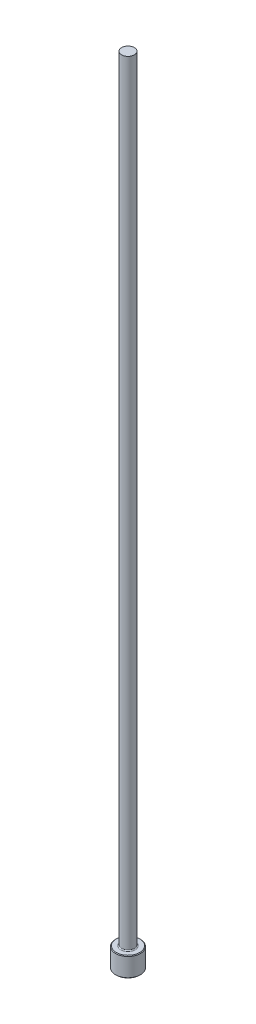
ISO-10303-21;
HEADER;
FILE_DESCRIPTION(('STEP AP214'),'2;1');
FILE_NAME('part.step','',(''),(''),'','','');
FILE_SCHEMA(('AUTOMOTIVE_DESIGN { 1 0 10303 214 1 1 1 1 }'));
ENDSEC;
DATA;
#1=APPLICATION_CONTEXT('core data for automotive mechanical design processes');
#2=APPLICATION_PROTOCOL_DEFINITION('international standard','automotive_design',2000,#1);
#3=PRODUCT_CONTEXT('',#1,'mechanical');
#4=PRODUCT('Part','Part','',(#3));
#5=PRODUCT_RELATED_PRODUCT_CATEGORY('part','',(#4));
#6=PRODUCT_DEFINITION_FORMATION('','',#4);
#7=PRODUCT_DEFINITION_CONTEXT('part definition',#1,'design');
#8=PRODUCT_DEFINITION('design','',#6,#7);
#9=PRODUCT_DEFINITION_SHAPE('','',#8);
#10=(LENGTH_UNIT() NAMED_UNIT(*) SI_UNIT(.MILLI.,.METRE.));
#11=(NAMED_UNIT(*) PLANE_ANGLE_UNIT() SI_UNIT($,.RADIAN.));
#12=(NAMED_UNIT(*) SI_UNIT($,.STERADIAN.) SOLID_ANGLE_UNIT());
#13=UNCERTAINTY_MEASURE_WITH_UNIT(LENGTH_MEASURE(1.E-05),#10,'distance_accuracy_value','');
#14=(GEOMETRIC_REPRESENTATION_CONTEXT(3) GLOBAL_UNCERTAINTY_ASSIGNED_CONTEXT((#13)) GLOBAL_UNIT_ASSIGNED_CONTEXT((#10,
#11,#12)) REPRESENTATION_CONTEXT('',''));
#15=CARTESIAN_POINT('',(0.,0.,0.));
#16=DIRECTION('',(0.,0.,1.));
#17=DIRECTION('',(1.,0.,0.));
#18=AXIS2_PLACEMENT_3D('',#15,#16,#17);
#19=CARTESIAN_POINT('',(0.,0.,0.));
#20=DIRECTION('',(0.,-1.,0.));
#21=DIRECTION('',(0.,0.,-1.));
#22=AXIS2_PLACEMENT_3D('',#19,#20,#21);
#23=PLANE('',#22);
#24=CARTESIAN_POINT('',(0.,0.,0.));
#25=DIRECTION('',(0.,-1.,0.));
#26=DIRECTION('',(0.,0.,-1.));
#27=AXIS2_PLACEMENT_3D('',#24,#25,#26);
#28=CIRCLE('',#27,0.939799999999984);
#29=CARTESIAN_POINT('',(0.,0.,0.939799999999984));
#30=VERTEX_POINT('',#29);
#31=EDGE_CURVE('E46',#30,#30,#28,.T.);
#32=ORIENTED_EDGE('',*,*,#31,.T.);
#33=EDGE_LOOP('',(#32));
#34=FACE_BOUND('',#33,.T.);
#35=ADVANCED_FACE('F35',(#34),#23,.T.);
#36=CARTESIAN_POINT('',(0.,259.958771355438,0.));
#37=DIRECTION('',(0.,1.,0.));
#38=DIRECTION('',(0.,0.,1.));
#39=AXIS2_PLACEMENT_3D('',#36,#37,#38);
#40=CYLINDRICAL_SURFACE('',#39,0.990599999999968);
#41=CARTESIAN_POINT('',(0.,1.52399999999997,0.));
#42=DIRECTION('',(0.,1.,0.));
#43=DIRECTION('',(0.,0.,1.));
#44=AXIS2_PLACEMENT_3D('',#41,#42,#43);
#45=CIRCLE('',#44,0.990599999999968);
#46=CARTESIAN_POINT('',(0.,1.52399999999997,0.990599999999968));
#47=VERTEX_POINT('',#46);
#48=EDGE_CURVE('E50',#47,#47,#45,.F.);
#49=ORIENTED_EDGE('',*,*,#48,.T.);
#50=EDGE_LOOP('',(#49));
#51=FACE_BOUND('',#50,.T.);
#52=CARTESIAN_POINT('',(0.,0.050799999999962,0.));
#53=DIRECTION('',(0.,-1.,0.));
#54=DIRECTION('',(0.,0.,-1.));
#55=AXIS2_PLACEMENT_3D('',#52,#53,#54);
#56=CIRCLE('',#55,0.990599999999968);
#57=CARTESIAN_POINT('',(0.,0.050799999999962,0.990599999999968));
#58=VERTEX_POINT('',#57);
#59=EDGE_CURVE('E55',#58,#58,#56,.F.);
#60=ORIENTED_EDGE('',*,*,#59,.T.);
#61=EDGE_LOOP('',(#60));
#62=FACE_BOUND('',#61,.T.);
#63=ADVANCED_FACE('F77',(#51,#62),#40,.T.);
#64=CARTESIAN_POINT('',(-0.990599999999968,1.5748,0.));
#65=DIRECTION('',(0.,1.,0.));
#66=DIRECTION('',(0.,0.,1.));
#67=AXIS2_PLACEMENT_3D('',#64,#65,#66);
#68=PLANE('',#67);
#69=CARTESIAN_POINT('',(0.,1.5748,0.));
#70=DIRECTION('',(0.,1.,0.));
#71=DIRECTION('',(0.,0.,1.));
#72=AXIS2_PLACEMENT_3D('',#69,#70,#71);
#73=CIRCLE('',#72,0.584199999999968);
#74=CARTESIAN_POINT('',(0.,1.5748,0.584199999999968));
#75=VERTEX_POINT('',#74);
#76=EDGE_CURVE('E10',#75,#75,#73,.F.);
#77=ORIENTED_EDGE('',*,*,#76,.T.);
#78=EDGE_LOOP('',(#77));
#79=FACE_BOUND('',#78,.T.);
#80=CARTESIAN_POINT('',(0.,1.5748,0.));
#81=DIRECTION('',(0.,1.,0.));
#82=DIRECTION('',(0.,0.,1.));
#83=AXIS2_PLACEMENT_3D('',#80,#81,#82);
#84=CIRCLE('',#83,0.939799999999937);
#85=CARTESIAN_POINT('',(0.,1.5748,0.939799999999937));
#86=VERTEX_POINT('',#85);
#87=EDGE_CURVE('E58',#86,#86,#84,.T.);
#88=ORIENTED_EDGE('',*,*,#87,.T.);
#89=EDGE_LOOP('',(#88));
#90=FACE_BOUND('',#89,.T.);
#91=ADVANCED_FACE('F69',(#79,#90),#68,.T.);
#92=CARTESIAN_POINT('',(0.,259.958771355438,0.));
#93=DIRECTION('',(0.,1.,0.));
#94=DIRECTION('',(0.,0.,1.));
#95=AXIS2_PLACEMENT_3D('',#92,#93,#94);
#96=CYLINDRICAL_SURFACE('',#95,0.507999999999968);
#97=CARTESIAN_POINT('',(0.,1.65100000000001,0.));
#98=DIRECTION('',(0.,1.,0.));
#99=DIRECTION('',(0.,0.,1.));
#100=AXIS2_PLACEMENT_3D('',#97,#98,#99);
#101=CIRCLE('',#100,0.507999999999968);
#102=CARTESIAN_POINT('',(0.,1.65100000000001,0.507999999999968));
#103=VERTEX_POINT('',#102);
#104=EDGE_CURVE('E42',#103,#103,#101,.T.);
#105=ORIENTED_EDGE('',*,*,#104,.T.);
#106=EDGE_LOOP('',(#105));
#107=FACE_BOUND('',#106,.T.);
#108=CARTESIAN_POINT('',(0.,63.5,0.));
#109=DIRECTION('',(0.,1.,0.));
#110=DIRECTION('',(0.,0.,1.));
#111=AXIS2_PLACEMENT_3D('',#108,#109,#110);
#112=CIRCLE('',#111,0.507999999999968);
#113=CARTESIAN_POINT('',(0.,63.5,0.507999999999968));
#114=VERTEX_POINT('',#113);
#115=EDGE_CURVE('E61',#114,#114,#112,.T.);
#116=ORIENTED_EDGE('',*,*,#115,.F.);
#117=EDGE_LOOP('',(#116));
#118=FACE_BOUND('',#117,.T.);
#119=ADVANCED_FACE('F67',(#107,#118),#96,.T.);
#120=CARTESIAN_POINT('',(-0.507999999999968,63.5,0.));
#121=DIRECTION('',(0.,1.,0.));
#122=DIRECTION('',(0.,0.,1.));
#123=AXIS2_PLACEMENT_3D('',#120,#121,#122);
#124=PLANE('',#123);
#125=ORIENTED_EDGE('',*,*,#115,.T.);
#126=EDGE_LOOP('',(#125));
#127=FACE_BOUND('',#126,.T.);
#128=ADVANCED_FACE('F65',(#127),#124,.T.);
#129=CARTESIAN_POINT('',(0.,1.57479999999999,0.));
#130=DIRECTION('',(0.,-1.,0.));
#131=DIRECTION('',(0.,0.,-1.));
#132=AXIS2_PLACEMENT_3D('',#129,#130,#131);
#133=CONICAL_SURFACE('',#132,0.939799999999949,0.785398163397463);
#134=ORIENTED_EDGE('',*,*,#48,.F.);
#135=EDGE_LOOP('',(#134));
#136=FACE_BOUND('',#135,.T.);
#137=ORIENTED_EDGE('',*,*,#87,.F.);
#138=EDGE_LOOP('',(#137));
#139=FACE_BOUND('',#138,.T.);
#140=ADVANCED_FACE('F75',(#136,#139),#133,.T.);
#141=CARTESIAN_POINT('',(0.,0.050799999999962,0.));
#142=DIRECTION('',(0.,1.,0.));
#143=DIRECTION('',(0.,0.,1.));
#144=AXIS2_PLACEMENT_3D('',#141,#142,#143);
#145=CONICAL_SURFACE('',#144,0.990599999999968,0.785398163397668);
#146=CARTESIAN_POINT('',(0.,0.,0.939799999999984));
#147=CARTESIAN_POINT('',(0.,0.000529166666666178,0.94032916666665));
#148=CARTESIAN_POINT('',(0.,0.00105833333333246,0.940858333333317));
#149=CARTESIAN_POINT('',(0.,0.00211666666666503,0.94191666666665));
#150=CARTESIAN_POINT('',(0.,0.00264583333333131,0.942445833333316));
#151=CARTESIAN_POINT('',(0.,0.00370416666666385,0.943504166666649));
#152=CARTESIAN_POINT('',(0.,0.0042333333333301,0.944033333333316));
#153=CARTESIAN_POINT('',(0.,0.00529166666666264,0.945091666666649));
#154=CARTESIAN_POINT('',(0.,0.00582083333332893,0.945620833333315));
#155=CARTESIAN_POINT('',(0.,0.00687916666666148,0.946679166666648));
#156=CARTESIAN_POINT('',(0.,0.00740833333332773,0.947208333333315));
#157=CARTESIAN_POINT('',(0.,0.00846666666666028,0.948266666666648));
#158=CARTESIAN_POINT('',(0.,0.00899583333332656,0.948795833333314));
#159=CARTESIAN_POINT('',(0.,0.0100541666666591,0.949854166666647));
#160=CARTESIAN_POINT('',(0.,0.0105833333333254,0.950383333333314));
#161=CARTESIAN_POINT('',(0.,0.0116416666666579,0.951441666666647));
#162=CARTESIAN_POINT('',(0.,0.0121708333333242,0.951970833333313));
#163=CARTESIAN_POINT('',(0.,0.0132291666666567,0.953029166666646));
#164=CARTESIAN_POINT('',(0.,0.013758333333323,0.953558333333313));
#165=CARTESIAN_POINT('',(0.,0.0148166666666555,0.954616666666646));
#166=CARTESIAN_POINT('',(0.,0.0153458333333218,0.955145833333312));
#167=CARTESIAN_POINT('',(0.,0.0164041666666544,0.956204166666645));
#168=CARTESIAN_POINT('',(0.,0.0169333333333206,0.956733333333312));
#169=CARTESIAN_POINT('',(0.,0.0179916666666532,0.957791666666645));
#170=CARTESIAN_POINT('',(0.,0.0185208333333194,0.958320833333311));
#171=CARTESIAN_POINT('',(0.,0.019579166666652,0.959379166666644));
#172=CARTESIAN_POINT('',(0.,0.0201083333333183,0.959908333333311));
#173=CARTESIAN_POINT('',(0.,0.0211666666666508,0.960966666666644));
#174=CARTESIAN_POINT('',(0.,0.0216958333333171,0.96149583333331));
#175=CARTESIAN_POINT('',(0.,0.0227541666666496,0.962554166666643));
#176=CARTESIAN_POINT('',(0.,0.0232833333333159,0.96308333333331));
#177=CARTESIAN_POINT('',(0.,0.0243416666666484,0.964141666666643));
#178=CARTESIAN_POINT('',(0.,0.0248708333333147,0.964670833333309));
#179=CARTESIAN_POINT('',(0.,0.0259291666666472,0.965729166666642));
#180=CARTESIAN_POINT('',(0.,0.0264583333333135,0.966258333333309));
#181=CARTESIAN_POINT('',(0.,0.0275166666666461,0.967316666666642));
#182=CARTESIAN_POINT('',(0.,0.0280458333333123,0.967845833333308));
#183=CARTESIAN_POINT('',(0.,0.0291041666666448,0.968904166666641));
#184=CARTESIAN_POINT('',(0.,0.0296333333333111,0.969433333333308));
#185=CARTESIAN_POINT('',(0.,0.0306916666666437,0.970491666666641));
#186=CARTESIAN_POINT('',(0.,0.03122083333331,0.971020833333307));
#187=CARTESIAN_POINT('',(0.,0.0322791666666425,0.97207916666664));
#188=CARTESIAN_POINT('',(0.,0.0328083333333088,0.972608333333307));
#189=CARTESIAN_POINT('',(0.,0.0338666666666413,0.97366666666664));
#190=CARTESIAN_POINT('',(0.,0.0343958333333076,0.974195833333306));
#191=CARTESIAN_POINT('',(0.,0.0354541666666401,0.975254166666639));
#192=CARTESIAN_POINT('',(0.,0.0359833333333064,0.975783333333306));
#193=CARTESIAN_POINT('',(0.,0.0370416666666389,0.976841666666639));
#194=CARTESIAN_POINT('',(0.,0.0375708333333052,0.977370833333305));
#195=CARTESIAN_POINT('',(0.,0.0386291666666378,0.978429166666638));
#196=CARTESIAN_POINT('',(0.,0.039158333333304,0.978958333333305));
#197=CARTESIAN_POINT('',(0.,0.0402166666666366,0.980016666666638));
#198=CARTESIAN_POINT('',(0.,0.0407458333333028,0.980545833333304));
#199=CARTESIAN_POINT('',(0.,0.0418041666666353,0.981604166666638));
#200=CARTESIAN_POINT('',(0.,0.0423333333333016,0.982133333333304));
#201=CARTESIAN_POINT('',(0.,0.0433916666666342,0.983191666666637));
#202=CARTESIAN_POINT('',(0.,0.0439208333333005,0.983720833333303));
#203=CARTESIAN_POINT('',(0.,0.044979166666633,0.984779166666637));
#204=CARTESIAN_POINT('',(0.,0.0455083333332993,0.985308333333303));
#205=CARTESIAN_POINT('',(0.,0.0465666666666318,0.986366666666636));
#206=CARTESIAN_POINT('',(0.,0.0470958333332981,0.986895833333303));
#207=CARTESIAN_POINT('',(0.,0.0481541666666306,0.987954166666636));
#208=CARTESIAN_POINT('',(0.,0.0486833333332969,0.988483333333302));
#209=CARTESIAN_POINT('',(0.,0.0497416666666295,0.989541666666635));
#210=CARTESIAN_POINT('',(0.,0.0502708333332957,0.990070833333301));
#211=CARTESIAN_POINT('',(0.,0.050799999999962,0.990599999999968));
#212=B_SPLINE_CURVE_WITH_KNOTS('',3,(#146,#147,#148,#149,#150,#151,#152,#153,#154,#155,#156,
#157,#158,#159,#160,#161,#162,#163,#164,#165,#166,#167,#168,#169,#170,#171,#172,#173,#174,#175,
#176,#177,#178,#179,#180,#181,#182,#183,#184,#185,#186,#187,#188,#189,#190,#191,#192,#193,#194,
#195,#196,#197,#198,#199,#200,#201,#202,#203,#204,#205,#206,#207,#208,#209,#210,#211),
.UNSPECIFIED.,.F.,.F.,(4,2,2,2,2,2,2,2,2,2,2,2,2,2,2,2,2,2,2,2,2,2,2,2,2,2,2,2,2,2,2,2,4),(0.,
0.00224506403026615,0.00449012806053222,0.00673519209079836,0.00898025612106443,
0.0112253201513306,0.0134703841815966,0.0157154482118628,0.0179605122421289,0.020205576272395,
0.0224506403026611,0.0246957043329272,0.0269407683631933,0.0291858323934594,0.0314308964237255,
0.0336759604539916,0.0359210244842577,0.0381660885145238,0.0404111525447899,0.042656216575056,
0.0449012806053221,0.0471463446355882,0.0493914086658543,0.0516364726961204,0.0538815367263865,
0.0561266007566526,0.0583716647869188,0.0606167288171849,0.0628617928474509,0.065106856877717,
0.0673519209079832,0.0695969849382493,0.0718420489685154),.UNSPECIFIED.);
#213=EDGE_CURVE('BSEAM89',#30,#58,#212,.T.);
#214=ORIENTED_EDGE('',*,*,#31,.F.);
#215=ORIENTED_EDGE('',*,*,#59,.F.);
#216=ORIENTED_EDGE('',*,*,#213,.T.);
#217=ORIENTED_EDGE('',*,*,#213,.F.);
#218=EDGE_LOOP('',(#214,#216,#215,#217));
#219=FACE_BOUND('',#218,.T.);
#220=ADVANCED_FACE('F89',(#219),#145,.T.);
#221=CARTESIAN_POINT('',(0.,1.65100000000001,0.));
#222=DIRECTION('',(0.,1.,0.));
#223=DIRECTION('',(0.,0.,1.));
#224=AXIS2_PLACEMENT_3D('',#221,#222,#223);
#225=TOROIDAL_SURFACE('',#224,0.584199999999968,0.0762);
#226=ORIENTED_EDGE('',*,*,#76,.F.);
#227=EDGE_LOOP('',(#226));
#228=FACE_BOUND('',#227,.T.);
#229=ORIENTED_EDGE('',*,*,#104,.F.);
#230=EDGE_LOOP('',(#229));
#231=FACE_BOUND('',#230,.T.);
#232=ADVANCED_FACE('F37',(#228,#231),#225,.F.);
#233=CLOSED_SHELL('',(#35,#63,#91,#119,#128,#140,#220,#232));
#234=MANIFOLD_SOLID_BREP('B2',#233);
#235=ADVANCED_BREP_SHAPE_REPRESENTATION('',(#18,#234),#14);
#236=SHAPE_DEFINITION_REPRESENTATION(#9,#235);
ENDSEC;
END-ISO-10303-21;
